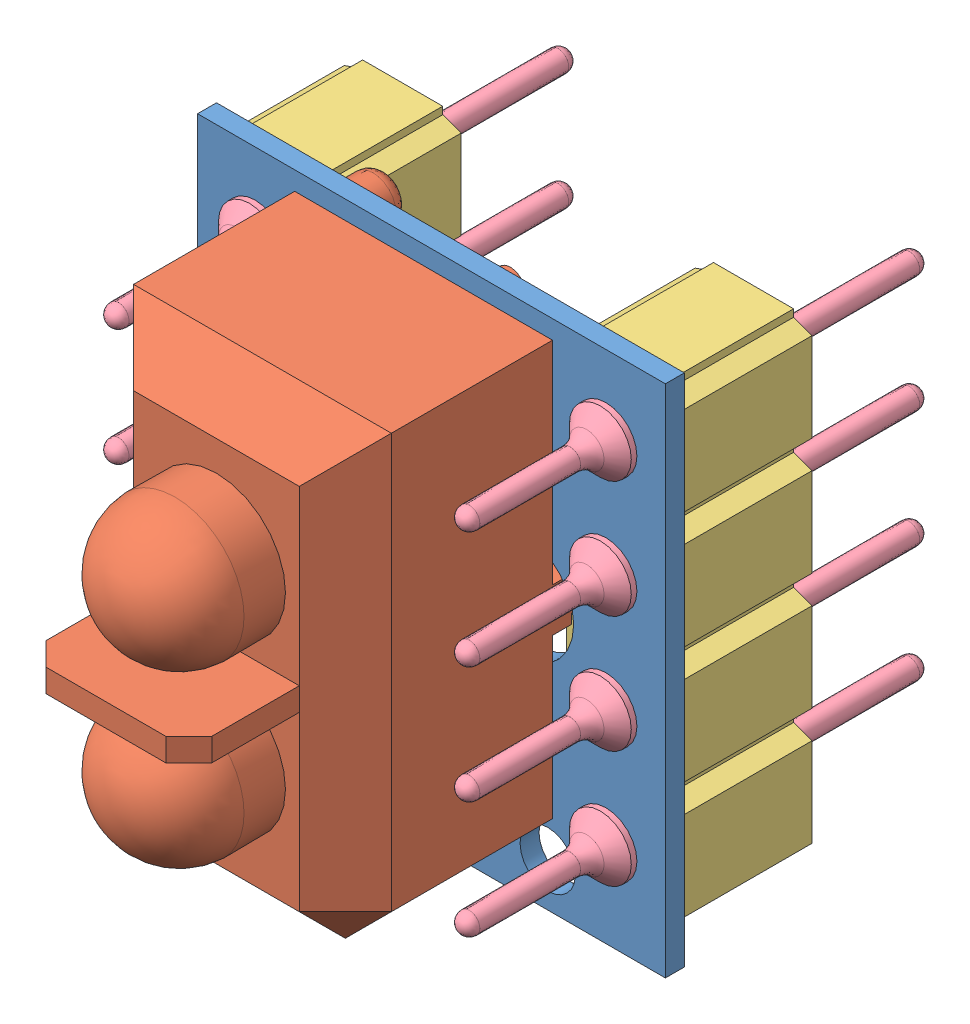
SolidWorks assembly TCRT5000 Breakout Board Fully Assembled.SLDASM, configuration Default (file format 7000). Lengths in mm.
Overall size (10.18 11.18 13.71).
14 component instances, 4 part files, 9 mates.
Components (placement in the parent):
- TCRT5000 Breakout Board-1: TCRT5000 Breakout Board.SLDPRT [Default] at (-56.884 11.4692 23.5029) size (10.16 11.18 0.41)
- TCR5000-1: TCR5000.SLDPRT [Default] at (-59.087 11.6522 23.5029) size (6.4 10 9.9)
- 4 Pin Header-1: 4 Pin Header.SLDASM [Default] at (-53.857 16.3496 20.2974) x (0 -1 0) z (1 0 0) size (10.16 10.01 2.54)
  - mill-max-350-40-104-00-006000_P3XX-11-010-00-000000(P304-11-010-00-000000)-1: mill-max-350-40-104-00-006000_P3XX-11-010-00-000000(P304-11-010-00-000000).sldprt [Default] at origin size (10.16 2.79 2.54)
  - mill-max-350-40-104-00-006000_3404(3404-0-00-80-00-00-03-0)-1: mill-max-350-40-104-00-006000_3404(3404-0-00-80-00-00-03-0).sldprt [Default] at (6.0444 3.6068 -1.27) x (0 -1 0) z (0 0 1) size (10.01 1.83 1.83)
  - mill-max-350-40-104-00-006000_3404(3404-0-00-80-00-00-03-0)-2: mill-max-350-40-104-00-006000_3404(3404-0-00-80-00-00-03-0).sldprt [Default] at (0.9644 3.6068 -1.27) x (0 -1 0) z (0 0 1) size (10.01 1.83 1.83)
  - mill-max-350-40-104-00-006000_3404(3404-0-00-80-00-00-03-0)-3: mill-max-350-40-104-00-006000_3404(3404-0-00-80-00-00-03-0).sldprt [Default] at (3.5044 3.6068 -1.27) x (0 -1 0) z (0 0 1) size (10.01 1.83 1.83)
  - mill-max-350-40-104-00-006000_3404(3404-0-00-80-00-00-03-0)-4: mill-max-350-40-104-00-006000_3404(3404-0-00-80-00-00-03-0).sldprt [Default] at (8.5844 3.6068 -1.27) x (0 -1 0) z (0 0 1) size (10.01 1.83 1.83)
- 4 Pin Header-2: 4 Pin Header.SLDASM [Default] at (-61.477 16.3496 20.2974) x (0 -1 0) z (1 0 0) size (10.16 10.01 2.54)
  - mill-max-350-40-104-00-006000_P3XX-11-010-00-000000(P304-11-010-00-000000)-1: mill-max-350-40-104-00-006000_P3XX-11-010-00-000000(P304-11-010-00-000000).sldprt [Default] at origin size (10.16 2.79 2.54)
  - mill-max-350-40-104-00-006000_3404(3404-0-00-80-00-00-03-0)-1: mill-max-350-40-104-00-006000_3404(3404-0-00-80-00-00-03-0).sldprt [Default] at (6.0444 3.6068 -1.27) x (0 -1 0) z (0 0 1) size (10.01 1.83 1.83)
  - mill-max-350-40-104-00-006000_3404(3404-0-00-80-00-00-03-0)-2: mill-max-350-40-104-00-006000_3404(3404-0-00-80-00-00-03-0).sldprt [Default] at (0.9644 3.6068 -1.27) x (0 -1 0) z (0 0 1) size (10.01 1.83 1.83)
  - mill-max-350-40-104-00-006000_3404(3404-0-00-80-00-00-03-0)-3: mill-max-350-40-104-00-006000_3404(3404-0-00-80-00-00-03-0).sldprt [Default] at (3.5044 3.6068 -1.27) x (0 -1 0) z (0 0 1) size (10.01 1.83 1.83)
  - mill-max-350-40-104-00-006000_3404(3404-0-00-80-00-00-03-0)-4: mill-max-350-40-104-00-006000_3404(3404-0-00-80-00-00-03-0).sldprt [Default] at (8.5844 3.6068 -1.27) x (0 -1 0) z (0 0 1) size (10.01 1.83 1.83)
Mates (geometry in assembly coordinates):
- Concentric3: concentric: circle of TCRT5000 Breakout Board-1; cylinder of TCR5000-1 through (-60.202 8.7422 20.5029) axis (0 0 1) radius 0.325
- Coincident1: coincident: plane of TCRT5000 Breakout Board-1 through (-63.996 5.8812 23.5029) normal (0 0 1); plane of TCR5000-1 through (-56.287 6.6522 23.5029) normal (0 0 -1)
- Parallel1: parallel: plane of TCRT5000 Breakout Board-1 through (-53.836 17.0572 23.0914) normal (1 0 0); plane of TCR5000-1 through (-56.287 16.6522 28.0029) normal (1 0 0)
- Concentric4: concentric: cylinder of TCRT5000 Breakout Board-1 through (-55.127 15.3852 23.0914) axis (0 0 -1) radius 0.5; cylinder of 4 Pin Header-1/mill-max-350-40-104-00-006000_3404(3404-0-00-80-00-00-03-0)-2 through (-55.127 15.3852 24.4312) axis (0 0 1) radius 0.2286
- Concentric5: concentric: circle of TCRT5000 Breakout Board-1; cylinder of 4 Pin Header-1/mill-max-350-40-104-00-006000_3404(3404-0-00-80-00-00-03-0)-4 through (-55.127 7.7652 16.6906) axis (0 0 -1) radius 0.2286
- Coincident2: coincident: plane of TCRT5000 Breakout Board-1 through (-63.996 5.8812 23.0914) normal (0 0 -1); plane of 4 Pin Header-1/mill-max-350-40-104-00-006000_P3XX-11-010-00-000000(P304-11-010-00-000000)-1 through (-56.397 16.3496 23.0914) normal (0 0 1)
- Concentric6: concentric aligned: cylinder of TCRT5000 Breakout Board-1 through (-62.747 15.3852 23.0914) axis (0 0 -1) radius 0.5; cylinder of 4 Pin Header-2/mill-max-350-40-104-00-006000_3404(3404-0-00-80-00-00-03-0)-2 through (-62.747 15.3852 16.6906) axis (0 0 -1) radius 0.2286
- Concentric7: concentric aligned: circle of TCRT5000 Breakout Board-1; cylinder of 4 Pin Header-2/mill-max-350-40-104-00-006000_3404(3404-0-00-80-00-00-03-0)-4 through (-62.747 7.7652 16.6906) axis (0 0 -1) radius 0.2286
- Coincident3: coincident anti-aligned: plane of TCRT5000 Breakout Board-1 through (-63.996 5.8812 23.0914) normal (0 0 -1); plane of 4 Pin Header-2/mill-max-350-40-104-00-006000_P3XX-11-010-00-000000(P304-11-010-00-000000)-1 through (-64.017 16.3496 23.0914) normal (0 0 1)
